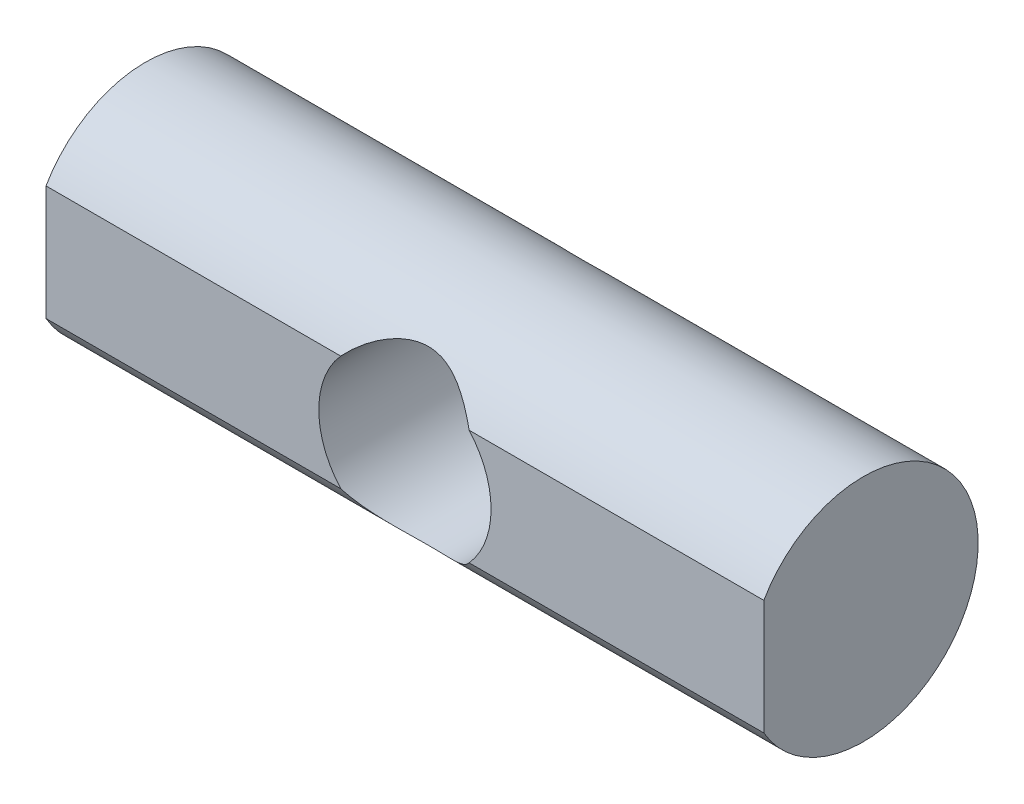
ISO-10303-21;
HEADER;
FILE_DESCRIPTION(('STEP AP214'),'2;1');
FILE_NAME('part.step','',(''),(''),'','','');
FILE_SCHEMA(('AUTOMOTIVE_DESIGN { 1 0 10303 214 1 1 1 1 }'));
ENDSEC;
DATA;
#1=APPLICATION_CONTEXT('core data for automotive mechanical design processes');
#2=APPLICATION_PROTOCOL_DEFINITION('international standard','automotive_design',2000,#1);
#3=PRODUCT_CONTEXT('',#1,'mechanical');
#4=PRODUCT('Part','Part','',(#3));
#5=PRODUCT_RELATED_PRODUCT_CATEGORY('part','',(#4));
#6=PRODUCT_DEFINITION_FORMATION('','',#4);
#7=PRODUCT_DEFINITION_CONTEXT('part definition',#1,'design');
#8=PRODUCT_DEFINITION('design','',#6,#7);
#9=PRODUCT_DEFINITION_SHAPE('','',#8);
#10=(LENGTH_UNIT() NAMED_UNIT(*) SI_UNIT(.MILLI.,.METRE.));
#11=(NAMED_UNIT(*) PLANE_ANGLE_UNIT() SI_UNIT($,.RADIAN.));
#12=(NAMED_UNIT(*) SI_UNIT($,.STERADIAN.) SOLID_ANGLE_UNIT());
#13=UNCERTAINTY_MEASURE_WITH_UNIT(LENGTH_MEASURE(1.E-05),#10,'distance_accuracy_value','');
#14=(GEOMETRIC_REPRESENTATION_CONTEXT(3) GLOBAL_UNCERTAINTY_ASSIGNED_CONTEXT((#13)) GLOBAL_UNIT_ASSIGNED_CONTEXT((#10,
#11,#12)) REPRESENTATION_CONTEXT('',''));
#15=CARTESIAN_POINT('',(0.,0.,0.));
#16=DIRECTION('',(0.,0.,1.));
#17=DIRECTION('',(1.,0.,0.));
#18=AXIS2_PLACEMENT_3D('',#15,#16,#17);
#19=CARTESIAN_POINT('',(25.,0.,6.92820323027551));
#20=DIRECTION('',(0.,0.,-1.));
#21=DIRECTION('',(-1.,0.,0.));
#22=AXIS2_PLACEMENT_3D('',#19,#20,#21);
#23=PLANE('',#22);
#24=DIRECTION('',(-1.,0.,0.));
#25=VECTOR('',#24,1.);
#26=CARTESIAN_POINT('',(25.,4.,6.92820323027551));
#27=LINE('',#26,#25);
#28=CARTESIAN_POINT('',(25.,4.,6.92820323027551));
#29=VERTEX_POINT('',#28);
#30=CARTESIAN_POINT('',(4.47213595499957,4.,6.92820323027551));
#31=VERTEX_POINT('',#30);
#32=EDGE_CURVE('E112',#29,#31,#27,.T.);
#33=ORIENTED_EDGE('',*,*,#32,.T.);
#34=CARTESIAN_POINT('',(0.,0.,6.92820323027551));
#35=DIRECTION('',(0.,0.,-1.));
#36=DIRECTION('',(-1.,0.,0.));
#37=AXIS2_PLACEMENT_3D('',#34,#35,#36);
#38=CIRCLE('',#37,6.);
#39=CARTESIAN_POINT('',(4.47213595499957,-4.,6.92820323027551));
#40=VERTEX_POINT('',#39);
#41=EDGE_CURVE('E13',#31,#40,#38,.T.);
#42=ORIENTED_EDGE('',*,*,#41,.T.);
#43=DIRECTION('',(-1.,0.,0.));
#44=VECTOR('',#43,1.);
#45=CARTESIAN_POINT('',(25.,-4.,6.92820323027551));
#46=LINE('',#45,#44);
#47=CARTESIAN_POINT('',(25.,-4.,6.92820323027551));
#48=VERTEX_POINT('',#47);
#49=EDGE_CURVE('E98',#48,#40,#46,.T.);
#50=ORIENTED_EDGE('',*,*,#49,.F.);
#51=DIRECTION('',(0.,-1.,0.));
#52=VECTOR('',#51,1.);
#53=CARTESIAN_POINT('',(25.,0.,6.92820323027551));
#54=LINE('',#53,#52);
#55=EDGE_CURVE('E74',#29,#48,#54,.T.);
#56=ORIENTED_EDGE('',*,*,#55,.F.);
#57=EDGE_LOOP('',(#33,#42,#50,#56));
#58=FACE_BOUND('',#57,.T.);
#59=ADVANCED_FACE('F50',(#58),#23,.F.);
#60=CARTESIAN_POINT('',(25.,0.,0.));
#61=DIRECTION('',(-1.,0.,0.));
#62=DIRECTION('',(0.,0.,1.));
#63=AXIS2_PLACEMENT_3D('',#60,#61,#62);
#64=CYLINDRICAL_SURFACE('',#63,8.);
#65=CARTESIAN_POINT('',(6.00000000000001,0.,-8.00000000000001));
#66=CARTESIAN_POINT('',(5.99999855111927,0.146518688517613,-7.99999860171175));
#67=CARTESIAN_POINT('',(5.99462323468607,0.29307406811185,-7.99596497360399));
#68=CARTESIAN_POINT('',(5.97320602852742,0.585027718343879,-7.97992114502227));
#69=CARTESIAN_POINT('',(5.95715775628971,0.73042524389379,-7.96790617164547));
#70=CARTESIAN_POINT('',(5.914620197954,1.01911421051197,-7.93615343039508));
#71=CARTESIAN_POINT('',(5.88811101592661,1.16240109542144,-7.91640094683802));
#72=CARTESIAN_POINT('',(5.82505997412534,1.44559149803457,-7.86961738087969));
#73=CARTESIAN_POINT('',(5.78851363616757,1.5854934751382,-7.84258304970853));
#74=CARTESIAN_POINT('',(5.7061890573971,1.86005596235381,-7.78201902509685));
#75=CARTESIAN_POINT('',(5.66047316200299,1.9947449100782,-7.74853325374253));
#76=CARTESIAN_POINT('',(5.56023333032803,2.25916456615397,-7.6756119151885));
#77=CARTESIAN_POINT('',(5.505705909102,2.38889328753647,-7.63617399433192));
#78=CARTESIAN_POINT('',(5.3298817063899,2.76953920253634,-7.51005474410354));
#79=CARTESIAN_POINT('',(5.19623372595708,3.012273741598,-7.41548618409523));
#80=CARTESIAN_POINT('',(4.8869365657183,3.49390424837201,-7.20197666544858));
#81=CARTESIAN_POINT('',(4.70854400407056,3.73036317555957,-7.08158969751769));
#82=CARTESIAN_POINT('',(4.32200330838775,4.17211842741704,-6.83066333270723));
#83=CARTESIAN_POINT('',(4.11380923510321,4.37736561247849,-6.70010840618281));
#84=CARTESIAN_POINT('',(3.75892860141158,4.67986589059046,-6.48984438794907));
#85=CARTESIAN_POINT('',(3.62073905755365,4.78758959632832,-6.410578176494));
#86=CARTESIAN_POINT('',(3.33482245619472,4.99096674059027,-6.25353789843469));
#87=CARTESIAN_POINT('',(3.18709254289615,5.08661653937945,-6.17576428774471));
#88=CARTESIAN_POINT('',(2.88242309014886,5.26524223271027,-6.02419554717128));
#89=CARTESIAN_POINT('',(2.72549297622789,5.3482307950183,-5.95039648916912));
#90=CARTESIAN_POINT('',(2.40252566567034,5.50089012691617,-5.80955994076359));
#91=CARTESIAN_POINT('',(2.23649372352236,5.57056847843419,-5.742518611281));
#92=CARTESIAN_POINT('',(1.84203716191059,5.71520702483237,-5.59908765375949));
#93=CARTESIAN_POINT('',(1.61029678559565,5.78504300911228,-5.52629839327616));
#94=CARTESIAN_POINT('',(1.25322422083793,5.86893397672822,-5.43666164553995));
#95=CARTESIAN_POINT('',(1.13269385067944,5.89341250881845,-5.41005011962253));
#96=CARTESIAN_POINT('',(0.888998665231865,5.93505989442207,-5.36432877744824));
#97=CARTESIAN_POINT('',(0.765835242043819,5.95223251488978,-5.3452150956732));
#98=CARTESIAN_POINT('',(0.51649226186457,5.9790556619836,-5.31519589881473));
#99=CARTESIAN_POINT('',(0.39029519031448,5.98863344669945,-5.30436979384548));
#100=CARTESIAN_POINT('',(0.137093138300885,5.99977184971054,-5.2917681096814));
#101=CARTESIAN_POINT('',(0.0100881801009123,6.00133268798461,-5.28999228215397));
#102=CARTESIAN_POINT('',(-0.243605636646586,5.99639499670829,-5.29558896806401));
#103=CARTESIAN_POINT('',(-0.370294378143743,5.98989382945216,-5.30296447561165));
#104=CARTESIAN_POINT('',(-0.622165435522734,5.96899506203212,-5.32647466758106));
#105=CARTESIAN_POINT('',(-0.747347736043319,5.9545973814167,-5.34260944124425));
#106=CARTESIAN_POINT('',(-1.09259974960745,5.90390904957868,-5.39872796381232));
#107=CARTESIAN_POINT('',(-1.31008445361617,5.85930415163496,-5.44749150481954));
#108=CARTESIAN_POINT('',(-1.73381660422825,5.74822214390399,-5.56456248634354));
#109=CARTESIAN_POINT('',(-1.94005302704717,5.68172401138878,-5.63288870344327));
#110=CARTESIAN_POINT('',(-2.30253558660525,5.54333905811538,-5.76879323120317));
#111=CARTESIAN_POINT('',(-2.46092753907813,5.47477466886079,-5.83413081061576));
#112=CARTESIAN_POINT('',(-2.76926478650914,5.3254608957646,-5.97073732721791));
#113=CARTESIAN_POINT('',(-2.9192056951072,5.24470526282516,-6.04200929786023));
#114=CARTESIAN_POINT('',(-3.21077106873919,5.07146578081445,-6.18814258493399));
#115=CARTESIAN_POINT('',(-3.35237762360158,4.9789579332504,-6.2630110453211));
#116=CARTESIAN_POINT('',(-3.62680230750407,4.78275541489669,-6.41409242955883));
#117=CARTESIAN_POINT('',(-3.75962180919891,4.67906249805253,-6.49030514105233));
#118=CARTESIAN_POINT('',(-4.01948396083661,4.4579792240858,-6.64417162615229));
#119=CARTESIAN_POINT('',(-4.14629607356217,4.34030912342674,-6.72181319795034));
#120=CARTESIAN_POINT('',(-4.38997703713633,4.09367222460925,-6.87480250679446));
#121=CARTESIAN_POINT('',(-4.50684488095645,3.9647042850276,-6.9501500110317));
#122=CARTESIAN_POINT('',(-4.72971618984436,3.69597060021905,-7.0967023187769));
#123=CARTESIAN_POINT('',(-4.83573945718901,3.55622538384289,-7.16791456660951));
#124=CARTESIAN_POINT('',(-5.03627268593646,3.2660452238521,-7.30470177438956));
#125=CARTESIAN_POINT('',(-5.13078173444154,3.11560943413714,-7.3702762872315));
#126=CARTESIAN_POINT('',(-5.28944850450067,2.83586827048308,-7.48169451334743));
#127=CARTESIAN_POINT('',(-5.35589118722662,2.70837998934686,-7.52885710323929));
#128=CARTESIAN_POINT('',(-5.48006470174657,2.44739928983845,-7.61769167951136));
#129=CARTESIAN_POINT('',(-5.53779732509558,2.31390811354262,-7.65936479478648));
#130=CARTESIAN_POINT('',(-5.64389841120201,2.04151155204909,-7.73642422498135));
#131=CARTESIAN_POINT('',(-5.69226841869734,1.9026070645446,-7.7718115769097));
#132=CARTESIAN_POINT('',(-5.77899694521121,1.6201859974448,-7.83555620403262));
#133=CARTESIAN_POINT('',(-5.81735953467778,1.47667131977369,-7.86391633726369));
#134=CARTESIAN_POINT('',(-5.88373225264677,1.18499204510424,-7.91314134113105));
#135=CARTESIAN_POINT('',(-5.91167393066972,1.03680340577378,-7.93395662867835));
#136=CARTESIAN_POINT('',(-5.95638008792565,0.737821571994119,-7.96732338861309));
#137=CARTESIAN_POINT('',(-5.97314453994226,0.587028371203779,-7.97987484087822));
#138=CARTESIAN_POINT('',(-5.99518818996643,0.284184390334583,-7.99638843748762));
#139=CARTESIAN_POINT('',(-6.00047121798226,0.132134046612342,-8.00035344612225));
#140=CARTESIAN_POINT('',(-5.99946289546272,-0.171899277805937,-7.99959713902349));
#141=CARTESIAN_POINT('',(-5.99317245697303,-0.323882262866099,-7.99487650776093));
#142=CARTESIAN_POINT('',(-5.97035382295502,-0.611142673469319,-7.97778638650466));
#143=CARTESIAN_POINT('',(-5.95492267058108,-0.746558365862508,-7.96623673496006));
#144=CARTESIAN_POINT('',(-5.91502578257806,-1.01535074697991,-7.93645725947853));
#145=CARTESIAN_POINT('',(-5.89055704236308,-1.14872674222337,-7.91822521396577));
#146=CARTESIAN_POINT('',(-5.83292491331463,-1.41251726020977,-7.87544532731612));
#147=CARTESIAN_POINT('',(-5.7997636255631,-1.54293249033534,-7.85089901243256));
#148=CARTESIAN_POINT('',(-5.72516312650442,-1.80012948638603,-7.79595168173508));
#149=CARTESIAN_POINT('',(-5.68372071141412,-1.92690982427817,-7.76554840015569));
#150=CARTESIAN_POINT('',(-5.54448784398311,-2.3095170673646,-7.66401781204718));
#151=CARTESIAN_POINT('',(-5.43380652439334,-2.55847497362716,-7.58408997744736));
#152=CARTESIAN_POINT('',(-5.18329892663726,-3.03411583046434,-7.4066714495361));
#153=CARTESIAN_POINT('',(-5.04346861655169,-3.26079569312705,-7.30917832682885));
#154=CARTESIAN_POINT('',(-4.71287522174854,-3.72602689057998,-7.08477436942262));
#155=CARTESIAN_POINT('',(-4.51750608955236,-3.96023886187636,-6.95566976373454));
#156=CARTESIAN_POINT('',(-4.09594469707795,-4.39490724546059,-6.68953209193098));
#157=CARTESIAN_POINT('',(-3.86968418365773,-4.59528664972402,-6.55248186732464));
#158=CARTESIAN_POINT('',(-3.4863511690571,-4.88646983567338,-6.3356789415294));
#159=CARTESIAN_POINT('',(-3.33831682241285,-4.98880902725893,-6.25517542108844));
#160=CARTESIAN_POINT('',(-3.03231400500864,-5.1805106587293,-6.09735213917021));
#161=CARTESIAN_POINT('',(-2.87434191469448,-5.26986833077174,-6.02003355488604));
#162=CARTESIAN_POINT('',(-2.54899729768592,-5.43468173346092,-5.87166976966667));
#163=CARTESIAN_POINT('',(-2.38164811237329,-5.51017014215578,-5.80061003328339));
#164=CARTESIAN_POINT('',(-2.03760658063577,-5.64645066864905,-5.66803470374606));
#165=CARTESIAN_POINT('',(-1.86092212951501,-5.70725497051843,-5.60651121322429));
#166=CARTESIAN_POINT('',(-1.45838333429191,-5.82460895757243,-5.48476590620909));
#167=CARTESIAN_POINT('',(-1.23029797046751,-5.87724209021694,-5.42784261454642));
#168=CARTESIAN_POINT('',(-0.881291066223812,-5.93609963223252,-5.36316560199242));
#169=CARTESIAN_POINT('',(-0.763874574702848,-5.95236673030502,-5.34506213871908));
#170=CARTESIAN_POINT('',(-0.527390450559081,-5.97795743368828,-5.31642768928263));
#171=CARTESIAN_POINT('',(-0.408323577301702,-5.98728413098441,-5.30589333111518));
#172=CARTESIAN_POINT('',(-0.168761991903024,-5.99883169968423,-5.29283429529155));
#173=CARTESIAN_POINT('',(-0.0482630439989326,-6.00101405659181,-5.29035303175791));
#174=CARTESIAN_POINT('',(0.19253165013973,-5.99811868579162,-5.29363550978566));
#175=CARTESIAN_POINT('',(0.312827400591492,-5.99304111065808,-5.29939907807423));
#176=CARTESIAN_POINT('',(0.552353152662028,-5.97572919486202,-5.31891233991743));
#177=CARTESIAN_POINT('',(0.671582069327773,-5.9634882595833,-5.3326693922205));
#178=CARTESIAN_POINT('',(0.908071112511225,-5.93208637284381,-5.36757846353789));
#179=CARTESIAN_POINT('',(1.02533018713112,-5.91292183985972,-5.38873430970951));
#180=CARTESIAN_POINT('',(1.28241486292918,-5.86311195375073,-5.44293592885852));
#181=CARTESIAN_POINT('',(1.42159805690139,-5.83087573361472,-5.47756729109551));
#182=CARTESIAN_POINT('',(1.69529553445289,-5.75726364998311,-5.55488600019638));
#183=CARTESIAN_POINT('',(1.82980620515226,-5.7158808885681,-5.59757942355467));
#184=CARTESIAN_POINT('',(2.09391587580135,-5.62450733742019,-5.68938628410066));
#185=CARTESIAN_POINT('',(2.22350451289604,-5.57449949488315,-5.73851239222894));
#186=CARTESIAN_POINT('',(2.47725011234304,-5.46646540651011,-5.84151757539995));
#187=CARTESIAN_POINT('',(2.60140871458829,-5.40844160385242,-5.89539520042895));
#188=CARTESIAN_POINT('',(2.88646847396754,-5.26327089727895,-6.02582021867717));
#189=CARTESIAN_POINT('',(3.04515916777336,-5.17300719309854,-6.10374359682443));
#190=CARTESIAN_POINT('',(3.35258751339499,-4.97927518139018,-6.26279038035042));
#191=CARTESIAN_POINT('',(3.5013220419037,-4.87580275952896,-6.34391477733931));
#192=CARTESIAN_POINT('',(3.78871985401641,-4.65600132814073,-6.50694942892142));
#193=CARTESIAN_POINT('',(3.92737546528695,-4.53966269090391,-6.58886022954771));
#194=CARTESIAN_POINT('',(4.19406314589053,-4.29448893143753,-6.75122092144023));
#195=CARTESIAN_POINT('',(4.32209650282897,-4.16565532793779,-6.83167098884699));
#196=CARTESIAN_POINT('',(4.56792525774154,-3.89458755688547,-6.98977923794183));
#197=CARTESIAN_POINT('',(4.68562553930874,-3.75224983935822,-7.06740826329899));
#198=CARTESIAN_POINT('',(4.90862399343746,-3.45541107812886,-7.21718567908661));
#199=CARTESIAN_POINT('',(5.01392054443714,-3.30090844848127,-7.28933335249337));
#200=CARTESIAN_POINT('',(5.21068253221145,-2.98061143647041,-7.42605002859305));
#201=CARTESIAN_POINT('',(5.3021741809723,-2.81483934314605,-7.49063334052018));
#202=CARTESIAN_POINT('',(5.47011844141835,-2.47266590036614,-7.61043577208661));
#203=CARTESIAN_POINT('',(5.54657881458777,-2.29627009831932,-7.66565972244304));
#204=CARTESIAN_POINT('',(5.66298113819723,-1.98729924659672,-7.75037220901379));
#205=CARTESIAN_POINT('',(5.70705839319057,-1.85703204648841,-7.78265986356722));
#206=CARTESIAN_POINT('',(5.78644563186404,-1.59251360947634,-7.84106039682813));
#207=CARTESIAN_POINT('',(5.82175774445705,-1.45826334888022,-7.86717477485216));
#208=CARTESIAN_POINT('',(5.8830816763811,-1.18687071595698,-7.9126625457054));
#209=CARTESIAN_POINT('',(5.90911499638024,-1.04973581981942,-7.93205151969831));
#210=CARTESIAN_POINT('',(5.95160956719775,-0.773232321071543,-7.96375884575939));
#211=CARTESIAN_POINT('',(5.96807571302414,-0.633864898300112,-7.97608081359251));
#212=CARTESIAN_POINT('',(5.98641344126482,-0.411868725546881,-7.98981401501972));
#213=CARTESIAN_POINT('',(5.99150492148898,-0.329635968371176,-7.99363034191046));
#214=CARTESIAN_POINT('',(5.99829888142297,-0.16493937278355,-7.9987239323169));
#215=CARTESIAN_POINT('',(6.00000081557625,-0.082475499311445,-8.0000007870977));
#216=CARTESIAN_POINT('',(6.00000000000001,0.,-8.00000000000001));
#217=B_SPLINE_CURVE_WITH_KNOTS('',3,(#65,#66,#67,#68,#69,#70,#71,#72,#73,#74,#75,#76,#77,#78,
#79,#80,#81,#82,#83,#84,#85,#86,#87,#88,#89,#90,#91,#92,#93,#94,#95,#96,#97,#98,#99,#100,#101,
#102,#103,#104,#105,#106,#107,#108,#109,#110,#111,#112,#113,#114,#115,#116,#117,#118,#119,#120,
#121,#122,#123,#124,#125,#126,#127,#128,#129,#130,#131,#132,#133,#134,#135,#136,#137,#138,#139,
#140,#141,#142,#143,#144,#145,#146,#147,#148,#149,#150,#151,#152,#153,#154,#155,#156,#157,#158,
#159,#160,#161,#162,#163,#164,#165,#166,#167,#168,#169,#170,#171,#172,#173,#174,#175,#176,#177,
#178,#179,#180,#181,#182,#183,#184,#185,#186,#187,#188,#189,#190,#191,#192,#193,#194,#195,#196,
#197,#198,#199,#200,#201,#202,#203,#204,#205,#206,#207,#208,#209,#210,#211,#212,#213,#214,#215,
#216),.UNSPECIFIED.,.T.,.F.,(4,2,2,2,2,2,2,2,2,2,2,2,2,2,2,2,2,2,2,2,2,2,2,2,2,2,2,2,2,2,2,2,2,
2,2,2,2,2,2,2,2,2,2,2,2,2,2,2,2,2,2,2,2,2,2,2,2,2,2,2,2,2,2,2,2,2,2,2,2,2,2,2,2,2,2,4),(0.,
0.439467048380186,0.879197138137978,1.31976762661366,1.76053500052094,2.19840134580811,
2.63644129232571,3.51138555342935,4.46735321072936,5.42481069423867,6.00121633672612,
6.57779532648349,7.1537936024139,7.72946278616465,8.48458056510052,8.86171322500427,
9.23865119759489,9.61915721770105,9.99965279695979,10.3802728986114,10.7608968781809,
11.4400527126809,12.1198626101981,12.672786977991,13.2259957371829,13.7803528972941,
14.3346232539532,14.9028885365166,15.4712112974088,16.0384770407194,16.6057877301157,
17.0592631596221,17.5126451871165,17.9659523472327,18.4190748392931,18.8751233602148,
19.331172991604,19.7870704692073,20.2429320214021,20.6527966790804,21.0627977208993,
21.4726997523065,21.8827606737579,22.7310038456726,23.5793644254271,24.5694015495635,
25.5616626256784,26.1525200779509,26.7435939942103,27.3332568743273,27.9224287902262,
28.6419314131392,29.0012926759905,29.3604937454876,29.7216280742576,30.0827548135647,
30.4442145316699,30.8058614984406,31.2462116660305,31.6868950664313,32.1284599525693,
32.5698905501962,33.1645896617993,33.7594744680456,34.3548074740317,34.9500682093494,
35.5503331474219,36.1506764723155,36.7498651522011,37.348743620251,37.7721112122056,
38.1953758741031,38.6176532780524,39.0397144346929,39.2870510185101,39.5344274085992),.UNSPECIFIED.);
#218=CARTESIAN_POINT('',(6.00000000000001,0.,-8.00000000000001));
#219=VERTEX_POINT('',#218);
#220=EDGE_CURVE('E119',#219,#219,#217,.T.);
#221=ORIENTED_EDGE('',*,*,#220,.T.);
#222=EDGE_LOOP('',(#221));
#223=FACE_BOUND('',#222,.T.);
#224=ORIENTED_EDGE('',*,*,#49,.T.);
#225=CARTESIAN_POINT('',(4.47213595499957,-4.,6.92820323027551));
#226=CARTESIAN_POINT('',(4.35406056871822,-4.13196316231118,6.85203734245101));
#227=CARTESIAN_POINT('',(4.23071329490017,-4.25815943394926,6.77412929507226));
#228=CARTESIAN_POINT('',(3.9738503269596,-4.49884552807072,6.6167207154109));
#229=CARTESIAN_POINT('',(3.84032873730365,-4.61332847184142,6.53721927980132));
#230=CARTESIAN_POINT('',(3.56210256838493,-4.83145919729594,6.37773284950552));
#231=CARTESIAN_POINT('',(3.4172907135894,-4.93497326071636,6.29775221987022));
#232=CARTESIAN_POINT('',(3.11802964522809,-5.12929957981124,6.14051181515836));
#233=CARTESIAN_POINT('',(2.96358381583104,-5.2201162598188,6.06325109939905));
#234=CARTESIAN_POINT('',(2.68451362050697,-5.36765883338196,5.93257247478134));
#235=CARTESIAN_POINT('',(2.56195410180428,-5.42726262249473,5.87798150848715));
#236=CARTESIAN_POINT('',(2.31141789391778,-5.53860466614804,5.77318815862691));
#237=CARTESIAN_POINT('',(2.18343957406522,-5.5903405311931,5.7229871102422));
#238=CARTESIAN_POINT('',(1.922763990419,-5.68525668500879,5.6287047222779));
#239=CARTESIAN_POINT('',(1.79008682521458,-5.72846919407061,5.58460053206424));
#240=CARTESIAN_POINT('',(1.51997375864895,-5.80597916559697,5.50397471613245));
#241=CARTESIAN_POINT('',(1.38254142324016,-5.84028315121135,5.46744754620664));
#242=CARTESIAN_POINT('',(1.13218642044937,-5.89330109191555,5.41019375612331));
#243=CARTESIAN_POINT('',(1.02002412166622,-5.91376981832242,5.38776284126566));
#244=CARTESIAN_POINT('',(0.793649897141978,-5.94837950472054,5.34952794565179));
#245=CARTESIAN_POINT('',(0.679438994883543,-5.96252353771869,5.33372074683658));
#246=CARTESIAN_POINT('',(0.449699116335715,-5.98423531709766,5.3093499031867));
#247=CARTESIAN_POINT('',(0.334171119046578,-5.99180766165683,5.30078119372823));
#248=CARTESIAN_POINT('',(0.102552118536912,-6.00024273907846,5.29123123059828));
#249=CARTESIAN_POINT('',(-0.0135388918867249,-6.00110538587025,5.29025007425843));
#250=CARTESIAN_POINT('',(-0.245399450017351,-5.99610057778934,5.29592246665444));
#251=CARTESIAN_POINT('',(-0.361168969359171,-5.99023254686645,5.30257666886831));
#252=CARTESIAN_POINT('',(-0.591540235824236,-5.97188871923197,5.32322470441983));
#253=CARTESIAN_POINT('',(-0.706141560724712,-5.95941061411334,5.33722110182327));
#254=CARTESIAN_POINT('',(-1.04722499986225,-5.91235427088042,5.38946704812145));
#255=CARTESIAN_POINT('',(-1.2708748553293,-5.86815673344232,5.43796978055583));
#256=CARTESIAN_POINT('',(-1.78808740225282,-5.73572053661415,5.57796468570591));
#257=CARTESIAN_POINT('',(-2.07643383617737,-5.63718365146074,5.67875603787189));
#258=CARTESIAN_POINT('',(-2.48983751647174,-5.46107196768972,5.84665490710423));
#259=CARTESIAN_POINT('',(-2.62471291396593,-5.3974886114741,5.9055463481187));
#260=CARTESIAN_POINT('',(-2.88804426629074,-5.26128750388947,6.02720235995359));
#261=CARTESIAN_POINT('',(-3.01650088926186,-5.1886706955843,6.08996652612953));
#262=CARTESIAN_POINT('',(-3.26620812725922,-5.03520175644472,6.21744718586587));
#263=CARTESIAN_POINT('',(-3.38749392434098,-4.95439623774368,6.28215129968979));
#264=CARTESIAN_POINT('',(-3.62354278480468,-4.78446223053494,6.41251828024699));
#265=CARTESIAN_POINT('',(-3.7383059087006,-4.695333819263,6.47818113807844));
#266=CARTESIAN_POINT('',(-3.96021802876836,-4.50970450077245,6.60873104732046));
#267=CARTESIAN_POINT('',(-4.06742264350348,-4.4132714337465,6.67361999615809));
#268=CARTESIAN_POINT('',(-4.27498357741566,-4.21251887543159,6.80212642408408));
#269=CARTESIAN_POINT('',(-4.3753400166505,-4.1081995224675,6.86574392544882));
#270=CARTESIAN_POINT('',(-4.47213595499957,-4.,6.92820323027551));
#271=B_SPLINE_CURVE_WITH_KNOTS('',3,(#225,#226,#227,#228,#229,#230,#231,#232,#233,#234,#235,
#236,#237,#238,#239,#240,#241,#242,#243,#244,#245,#246,#247,#248,#249,#250,#251,#252,#253,#254,
#255,#256,#257,#258,#259,#260,#261,#262,#263,#264,#265,#266,#267,#268,#269,#270),.UNSPECIFIED.,
.F.,.F.,(4,2,2,2,2,2,2,2,2,2,2,2,2,2,2,2,2,2,2,2,2,2,4),(0.,0.57808036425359,1.15649828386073,
1.74130820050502,2.32591383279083,2.7660192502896,3.20625806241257,3.64479935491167,
4.08301862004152,4.43127568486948,4.77936335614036,5.12720727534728,5.47505565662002,
5.82293381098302,6.17093353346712,6.86726406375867,7.82459613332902,8.30526342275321,
8.78588057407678,9.26390112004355,9.74191723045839,10.2159383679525,10.689951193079),.UNSPECIFIED.);
#272=CARTESIAN_POINT('',(-4.47213595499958,-4.,6.92820323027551));
#273=VERTEX_POINT('',#272);
#274=EDGE_CURVE('E96',#40,#273,#271,.T.);
#275=ORIENTED_EDGE('',*,*,#274,.T.);
#276=CARTESIAN_POINT('',(-25.,-4.,6.92820323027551));
#277=VERTEX_POINT('',#276);
#278=EDGE_CURVE('E88',#273,#277,#46,.T.);
#279=ORIENTED_EDGE('',*,*,#278,.T.);
#280=CARTESIAN_POINT('',(-25.,0.,0.));
#281=DIRECTION('',(1.,0.,0.));
#282=DIRECTION('',(0.,0.,-1.));
#283=AXIS2_PLACEMENT_3D('',#280,#281,#282);
#284=CIRCLE('',#283,8.);
#285=CARTESIAN_POINT('',(-25.,4.,6.92820323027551));
#286=VERTEX_POINT('',#285);
#287=EDGE_CURVE('E93',#277,#286,#284,.T.);
#288=ORIENTED_EDGE('',*,*,#287,.T.);
#289=CARTESIAN_POINT('',(-4.47213595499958,4.,6.92820323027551));
#290=VERTEX_POINT('',#289);
#291=EDGE_CURVE('E103',#290,#286,#27,.T.);
#292=ORIENTED_EDGE('',*,*,#291,.F.);
#293=CARTESIAN_POINT('',(-4.47213595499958,4.,6.92820323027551));
#294=CARTESIAN_POINT('',(-4.35406056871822,4.13196316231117,6.85203734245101));
#295=CARTESIAN_POINT('',(-4.23071329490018,4.25815943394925,6.77412929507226));
#296=CARTESIAN_POINT('',(-3.97385032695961,4.49884552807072,6.6167207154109));
#297=CARTESIAN_POINT('',(-3.84032873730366,4.61332847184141,6.53721927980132));
#298=CARTESIAN_POINT('',(-3.56210256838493,4.83145919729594,6.37773284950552));
#299=CARTESIAN_POINT('',(-3.41729071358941,4.93497326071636,6.29775221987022));
#300=CARTESIAN_POINT('',(-3.11802964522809,5.12929957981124,6.14051181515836));
#301=CARTESIAN_POINT('',(-2.96358381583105,5.2201162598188,6.06325109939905));
#302=CARTESIAN_POINT('',(-2.68451362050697,5.36765883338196,5.93257247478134));
#303=CARTESIAN_POINT('',(-2.56195410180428,5.42726262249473,5.87798150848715));
#304=CARTESIAN_POINT('',(-2.31141789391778,5.53860466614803,5.77318815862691));
#305=CARTESIAN_POINT('',(-2.18343957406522,5.5903405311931,5.7229871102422));
#306=CARTESIAN_POINT('',(-1.922763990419,5.68525668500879,5.6287047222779));
#307=CARTESIAN_POINT('',(-1.79008682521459,5.72846919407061,5.58460053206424));
#308=CARTESIAN_POINT('',(-1.51997375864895,5.80597916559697,5.50397471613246));
#309=CARTESIAN_POINT('',(-1.38254142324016,5.84028315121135,5.46744754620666));
#310=CARTESIAN_POINT('',(-1.13218642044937,5.89330109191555,5.41019375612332));
#311=CARTESIAN_POINT('',(-1.02002412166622,5.91376981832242,5.38776284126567));
#312=CARTESIAN_POINT('',(-0.79364989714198,5.94837950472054,5.34952794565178));
#313=CARTESIAN_POINT('',(-0.679438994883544,5.96252353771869,5.33372074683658));
#314=CARTESIAN_POINT('',(-0.449699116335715,5.98423531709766,5.3093499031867));
#315=CARTESIAN_POINT('',(-0.334171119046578,5.99180766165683,5.30078119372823));
#316=CARTESIAN_POINT('',(-0.102552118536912,6.00024273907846,5.29123123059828));
#317=CARTESIAN_POINT('',(0.0135388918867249,6.00110538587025,5.29025007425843));
#318=CARTESIAN_POINT('',(0.245399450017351,5.99610057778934,5.29592246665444));
#319=CARTESIAN_POINT('',(0.361168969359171,5.99023254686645,5.30257666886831));
#320=CARTESIAN_POINT('',(0.591540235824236,5.97188871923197,5.32322470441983));
#321=CARTESIAN_POINT('',(0.706141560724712,5.95941061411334,5.33722110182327));
#322=CARTESIAN_POINT('',(1.04722499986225,5.91235427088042,5.38946704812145));
#323=CARTESIAN_POINT('',(1.2708748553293,5.86815673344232,5.43796978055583));
#324=CARTESIAN_POINT('',(1.78808740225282,5.73572053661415,5.57796468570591));
#325=CARTESIAN_POINT('',(2.07643383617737,5.63718365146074,5.67875603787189));
#326=CARTESIAN_POINT('',(2.48983751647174,5.46107196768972,5.84665490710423));
#327=CARTESIAN_POINT('',(2.62471291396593,5.3974886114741,5.9055463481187));
#328=CARTESIAN_POINT('',(2.88804426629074,5.26128750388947,6.02720235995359));
#329=CARTESIAN_POINT('',(3.01650088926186,5.1886706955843,6.08996652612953));
#330=CARTESIAN_POINT('',(3.26620812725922,5.03520175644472,6.21744718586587));
#331=CARTESIAN_POINT('',(3.38749392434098,4.95439623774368,6.28215129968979));
#332=CARTESIAN_POINT('',(3.62354278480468,4.78446223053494,6.41251828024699));
#333=CARTESIAN_POINT('',(3.7383059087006,4.695333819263,6.47818113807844));
#334=CARTESIAN_POINT('',(3.96021802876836,4.50970450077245,6.60873104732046));
#335=CARTESIAN_POINT('',(4.06742264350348,4.4132714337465,6.67361999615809));
#336=CARTESIAN_POINT('',(4.27498357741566,4.21251887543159,6.80212642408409));
#337=CARTESIAN_POINT('',(4.3753400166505,4.1081995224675,6.86574392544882));
#338=CARTESIAN_POINT('',(4.47213595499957,4.,6.92820323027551));
#339=B_SPLINE_CURVE_WITH_KNOTS('',3,(#293,#294,#295,#296,#297,#298,#299,#300,#301,#302,#303,
#304,#305,#306,#307,#308,#309,#310,#311,#312,#313,#314,#315,#316,#317,#318,#319,#320,#321,#322,
#323,#324,#325,#326,#327,#328,#329,#330,#331,#332,#333,#334,#335,#336,#337,#338),.UNSPECIFIED.,
.F.,.F.,(4,2,2,2,2,2,2,2,2,2,2,2,2,2,2,2,2,2,2,2,2,2,4),(0.,0.578080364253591,1.15649828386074,
1.74130820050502,2.32591383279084,2.76601925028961,3.20625806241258,3.64479935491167,
4.08301862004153,4.43127568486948,4.77936335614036,5.12720727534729,5.47505565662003,
5.82293381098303,6.17093353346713,6.86726406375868,7.82459613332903,8.30526342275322,
8.78588057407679,9.26390112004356,9.7419172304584,10.2159383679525,10.689951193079),.UNSPECIFIED.);
#340=EDGE_CURVE('E66',#290,#31,#339,.T.);
#341=ORIENTED_EDGE('',*,*,#340,.T.);
#342=ORIENTED_EDGE('',*,*,#32,.F.);
#343=CARTESIAN_POINT('',(25.,0.,0.));
#344=DIRECTION('',(1.,0.,0.));
#345=DIRECTION('',(0.,0.,-1.));
#346=AXIS2_PLACEMENT_3D('',#343,#344,#345);
#347=CIRCLE('',#346,8.);
#348=EDGE_CURVE('E105',#48,#29,#347,.T.);
#349=ORIENTED_EDGE('',*,*,#348,.F.);
#350=EDGE_LOOP('',(#224,#275,#279,#288,#292,#341,#342,#349));
#351=FACE_BOUND('',#350,.T.);
#352=ADVANCED_FACE('F52',(#223,#351),#64,.T.);
#353=ORIENTED_EDGE('',*,*,#278,.F.);
#354=EDGE_CURVE('E55',#273,#290,#38,.T.);
#355=ORIENTED_EDGE('',*,*,#354,.T.);
#356=ORIENTED_EDGE('',*,*,#291,.T.);
#357=DIRECTION('',(0.,-1.,0.));
#358=VECTOR('',#357,1.);
#359=CARTESIAN_POINT('',(-25.,0.,6.92820323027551));
#360=LINE('',#359,#358);
#361=EDGE_CURVE('E101',#286,#277,#360,.T.);
#362=ORIENTED_EDGE('',*,*,#361,.T.);
#363=EDGE_LOOP('',(#353,#355,#356,#362));
#364=FACE_BOUND('',#363,.T.);
#365=ADVANCED_FACE('F102',(#364),#23,.F.);
#366=CARTESIAN_POINT('',(25.,0.,0.));
#367=DIRECTION('',(1.,0.,0.));
#368=DIRECTION('',(0.,0.,-1.));
#369=AXIS2_PLACEMENT_3D('',#366,#367,#368);
#370=PLANE('',#369);
#371=ORIENTED_EDGE('',*,*,#348,.T.);
#372=ORIENTED_EDGE('',*,*,#55,.T.);
#373=EDGE_LOOP('',(#371,#372));
#374=FACE_BOUND('',#373,.T.);
#375=ADVANCED_FACE('F137',(#374),#370,.T.);
#376=CARTESIAN_POINT('',(-25.,0.,0.));
#377=DIRECTION('',(1.,0.,0.));
#378=DIRECTION('',(0.,0.,-1.));
#379=AXIS2_PLACEMENT_3D('',#376,#377,#378);
#380=PLANE('',#379);
#381=ORIENTED_EDGE('',*,*,#287,.F.);
#382=ORIENTED_EDGE('',*,*,#361,.F.);
#383=EDGE_LOOP('',(#381,#382));
#384=FACE_BOUND('',#383,.T.);
#385=ADVANCED_FACE('F107',(#384),#380,.F.);
#386=CARTESIAN_POINT('',(0.,0.,-8.00000000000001));
#387=DIRECTION('',(0.,0.,1.));
#388=DIRECTION('',(1.,0.,0.));
#389=AXIS2_PLACEMENT_3D('',#386,#387,#388);
#390=CYLINDRICAL_SURFACE('',#389,6.);
#391=ORIENTED_EDGE('',*,*,#220,.F.);
#392=EDGE_LOOP('',(#391));
#393=FACE_BOUND('',#392,.T.);
#394=ORIENTED_EDGE('',*,*,#41,.F.);
#395=ORIENTED_EDGE('',*,*,#340,.F.);
#396=ORIENTED_EDGE('',*,*,#354,.F.);
#397=ORIENTED_EDGE('',*,*,#274,.F.);
#398=EDGE_LOOP('',(#394,#395,#396,#397));
#399=FACE_BOUND('',#398,.T.);
#400=ADVANCED_FACE('F132',(#393,#399),#390,.F.);
#401=CLOSED_SHELL('',(#59,#352,#365,#375,#385,#400));
#402=MANIFOLD_SOLID_BREP('B2',#401);
#403=ADVANCED_BREP_SHAPE_REPRESENTATION('',(#18,#402),#14);
#404=SHAPE_DEFINITION_REPRESENTATION(#9,#403);
ENDSEC;
END-ISO-10303-21;
